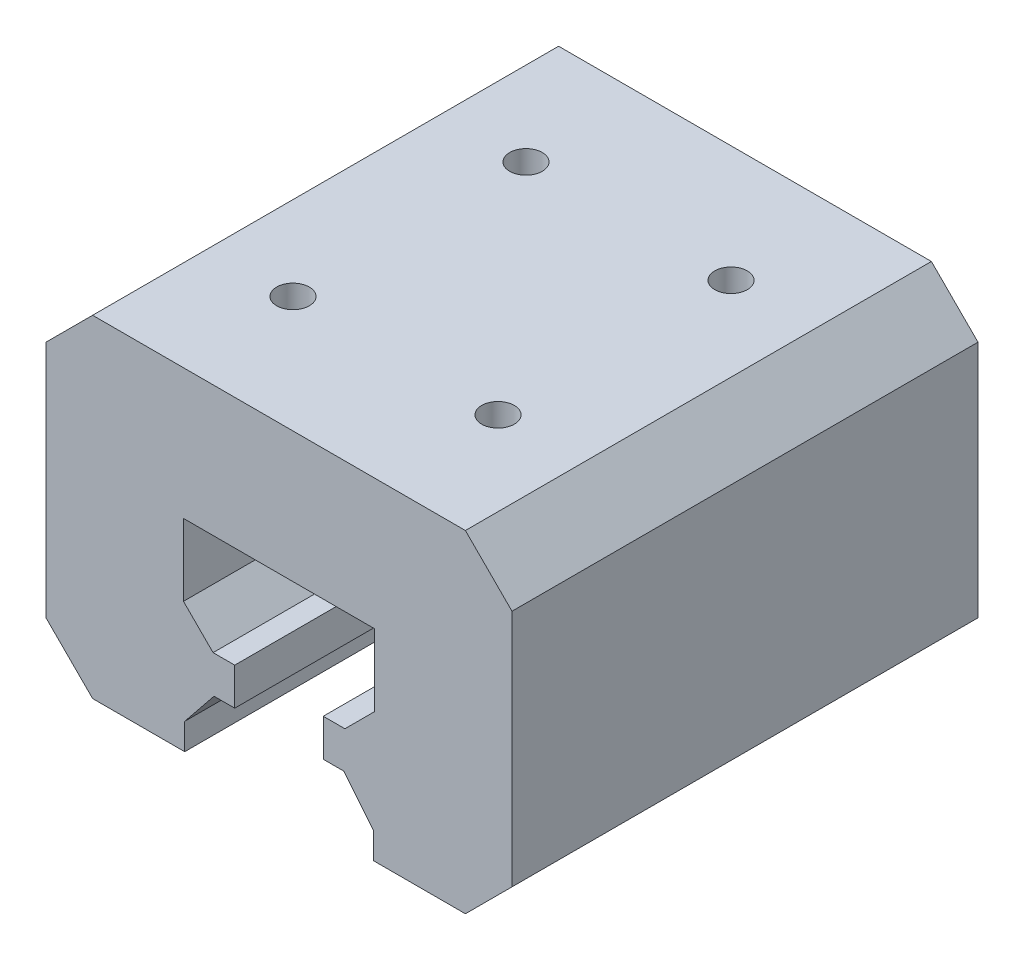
from build123d import *

# Parameters (mm, degrees)
DODANIE_WYCI_GNI_CIE1_DEPTH = 100
SFAZOWANIE1_SIZE            = 10
SFAZOWANIE2_SIZE            = 10
SFAZOWANIE3_SIZE            = 10
SFAZOWANIE4_SIZE            = 10
SZYK_LINIOWY1_COUNT         = 2
SZYK_LINIOWY1_PITCH         = 50


with BuildPart() as part:
    # Szkic2 → Dodanie-wyci_gni_cie1 (new body)
    with BuildSketch(Plane.XY):
        Polygon((-39.307712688, 43.231161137), (1.692287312, 43.231161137), (1.692287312, 27.816947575), (-4.662715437, 21.461944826), (-9.307712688, 21.461944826), (-9.307712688, 13.461944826), (-4.86204572, 13.461944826), (1.428368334, 5.646516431), (1.428368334, 0), (31.192287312, 0), (31.192287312, 71.231161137), (-68.807712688, 71.231161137), (-68.807712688, 0), (-39.043793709, 0), (-39.043793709, 5.646516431), (-32.753379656, 13.461944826), (-28.307712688, 13.461944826), (-28.307712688, 21.461944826), (-32.952709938, 21.461944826), (-39.307712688, 27.816947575), align=None)
    extrude(amount=DODANIE_WYCI_GNI_CIE1_DEPTH)

    # Sfazowanie1
    sfazowanie1_edges = [part.edges().sort_by_distance(p)[0] for p in [
        (31.192287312, 71.231161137, 50),
    ]]
    chamfer(sfazowanie1_edges, length=SFAZOWANIE1_SIZE)

    # Sfazowanie2
    sfazowanie2_edges = [part.edges().sort_by_distance(p)[0] for p in [
        (-68.807712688, 71.231161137, 50),
    ]]
    chamfer(sfazowanie2_edges, length=SFAZOWANIE2_SIZE)

    # Sfazowanie3
    sfazowanie3_edges = [part.edges().sort_by_distance(p)[0] for p in [
        (-68.807712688, 0, 50),
    ]]
    chamfer(sfazowanie3_edges, length=SFAZOWANIE3_SIZE)

    # Sfazowanie4
    sfazowanie4_edges = [part.edges().sort_by_distance(p)[0] for p in [
        (31.192287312, 0, 50),
    ]]
    chamfer(sfazowanie4_edges, length=SFAZOWANIE4_SIZE)

    # Szkic3 → Otw_r gwintowany M8x1.01 (revolve, cut)
    with BuildSketch(Plane(origin=(-40.807712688, 71.231161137, 25), x_dir=(0, 0, 1), z_dir=(1, 0, 0))):
        Polygon((0, 0), (0, 23.103012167), (3.5, 21), (3.5, 0), align=None)
    otw_r_gwintowany_m8x1_01 = revolve(axis=Axis((-40.807712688, 77.581161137, 25), (0, -1, 0)), mode=Mode.SUBTRACT)

    # Lustro1: Otw_r gwintowany M8x1.01 across plane
    add(otw_r_gwintowany_m8x1_01.mirror(Plane(origin=(-18.807712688, 0, 0), x_dir=(0, 0, 1), z_dir=(1, 0, 0))), mode=Mode.SUBTRACT)

    # Szyk liniowy1: Otw_r gwintowany M8x1.01 ×2
    with Locations(*[(0, 0, i * SZYK_LINIOWY1_PITCH) for i in range(1, SZYK_LINIOWY1_COUNT)]):
        add(otw_r_gwintowany_m8x1_01, mode=Mode.SUBTRACT)

    # Szyk liniowy1 copy 1 sketch → Szyk liniowy1 copy 1 (revolve, cut)
    with BuildSketch(Plane(origin=(3.192287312, 71.231161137, 75), x_dir=(0, 0, 1), z_dir=(-1, 0, 0))):
        Polygon((0, 0), (0, -23.103012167), (3.5, -21), (3.5, 0), align=None)
    revolve(axis=Axis((3.192287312, 77.581161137, 75), (0, 1, 0)), mode=Mode.SUBTRACT)


solid = part.part
